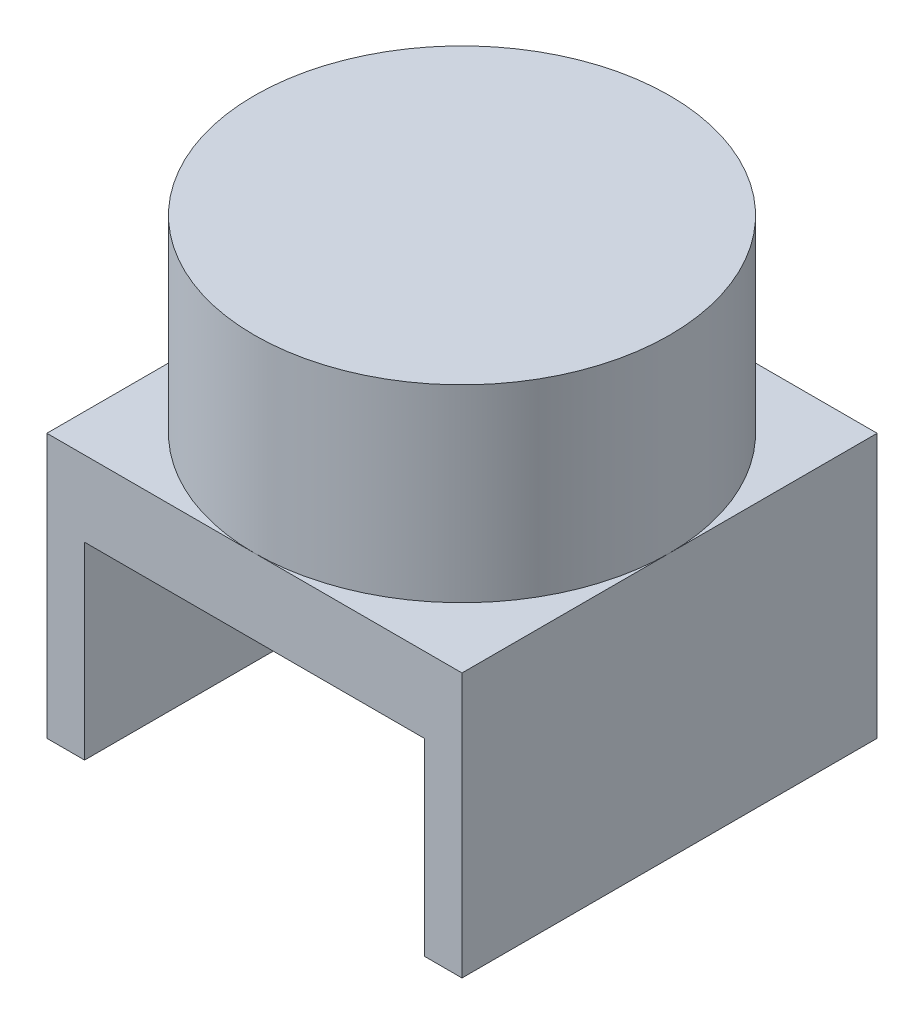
ISO-10303-21;
HEADER;
FILE_DESCRIPTION(('STEP AP214'),'2;1');
FILE_NAME('part.step','',(''),(''),'','','');
FILE_SCHEMA(('AUTOMOTIVE_DESIGN { 1 0 10303 214 1 1 1 1 }'));
ENDSEC;
DATA;
#1=APPLICATION_CONTEXT('core data for automotive mechanical design processes');
#2=APPLICATION_PROTOCOL_DEFINITION('international standard','automotive_design',2000,#1);
#3=PRODUCT_CONTEXT('',#1,'mechanical');
#4=PRODUCT('Part','Part','',(#3));
#5=PRODUCT_RELATED_PRODUCT_CATEGORY('part','',(#4));
#6=PRODUCT_DEFINITION_FORMATION('','',#4);
#7=PRODUCT_DEFINITION_CONTEXT('part definition',#1,'design');
#8=PRODUCT_DEFINITION('design','',#6,#7);
#9=PRODUCT_DEFINITION_SHAPE('','',#8);
#10=(LENGTH_UNIT() NAMED_UNIT(*) SI_UNIT(.MILLI.,.METRE.));
#11=(NAMED_UNIT(*) PLANE_ANGLE_UNIT() SI_UNIT($,.RADIAN.));
#12=(NAMED_UNIT(*) SI_UNIT($,.STERADIAN.) SOLID_ANGLE_UNIT());
#13=UNCERTAINTY_MEASURE_WITH_UNIT(LENGTH_MEASURE(1.E-05),#10,'distance_accuracy_value','');
#14=(GEOMETRIC_REPRESENTATION_CONTEXT(3) GLOBAL_UNCERTAINTY_ASSIGNED_CONTEXT((#13)) GLOBAL_UNIT_ASSIGNED_CONTEXT((#10,
#11,#12)) REPRESENTATION_CONTEXT('',''));
#15=CARTESIAN_POINT('',(0.,0.,0.));
#16=DIRECTION('',(0.,0.,1.));
#17=DIRECTION('',(1.,0.,0.));
#18=AXIS2_PLACEMENT_3D('',#15,#16,#17);
#19=CARTESIAN_POINT('',(0.,-20.,0.));
#20=DIRECTION('',(0.,1.,0.));
#21=DIRECTION('',(0.,0.,1.));
#22=AXIS2_PLACEMENT_3D('',#19,#20,#21);
#23=PLANE('',#22);
#24=DIRECTION('',(0.,0.,-1.));
#25=VECTOR('',#24,1.);
#26=CARTESIAN_POINT('',(45.,-20.,55.));
#27=LINE('',#26,#25);
#28=CARTESIAN_POINT('',(45.,-20.,55.));
#29=VERTEX_POINT('',#28);
#30=CARTESIAN_POINT('',(45.,-20.,-55.));
#31=VERTEX_POINT('',#30);
#32=EDGE_CURVE('E54',#29,#31,#27,.T.);
#33=ORIENTED_EDGE('',*,*,#32,.F.);
#34=DIRECTION('',(-1.,0.,0.));
#35=VECTOR('',#34,1.);
#36=CARTESIAN_POINT('',(-55.,-20.,55.));
#37=LINE('',#36,#35);
#38=CARTESIAN_POINT('',(-45.,-20.,55.));
#39=VERTEX_POINT('',#38);
#40=EDGE_CURVE('E167',#29,#39,#37,.T.);
#41=ORIENTED_EDGE('',*,*,#40,.T.);
#42=DIRECTION('',(0.,0.,1.));
#43=VECTOR('',#42,1.);
#44=CARTESIAN_POINT('',(-45.,-20.,55.));
#45=LINE('',#44,#43);
#46=CARTESIAN_POINT('',(-45.,-20.,-55.));
#47=VERTEX_POINT('',#46);
#48=EDGE_CURVE('E143',#47,#39,#45,.T.);
#49=ORIENTED_EDGE('',*,*,#48,.F.);
#50=DIRECTION('',(1.,0.,0.));
#51=VECTOR('',#50,1.);
#52=CARTESIAN_POINT('',(55.,-20.,-55.));
#53=LINE('',#52,#51);
#54=EDGE_CURVE('E59',#47,#31,#53,.T.);
#55=ORIENTED_EDGE('',*,*,#54,.T.);
#56=EDGE_LOOP('',(#33,#41,#49,#55));
#57=FACE_BOUND('',#56,.T.);
#58=ADVANCED_FACE('F39',(#57),#23,.F.);
#59=CARTESIAN_POINT('',(0.,50.,0.));
#60=DIRECTION('',(0.,-1.,0.));
#61=DIRECTION('',(0.,0.,-1.));
#62=AXIS2_PLACEMENT_3D('',#59,#60,#61);
#63=CYLINDRICAL_SURFACE('',#62,55.);
#64=CARTESIAN_POINT('',(0.,50.,0.));
#65=DIRECTION('',(0.,1.,0.));
#66=DIRECTION('',(0.,0.,1.));
#67=AXIS2_PLACEMENT_3D('',#64,#65,#66);
#68=CIRCLE('',#67,55.);
#69=CARTESIAN_POINT('',(0.,50.,55.));
#70=VERTEX_POINT('',#69);
#71=EDGE_CURVE('E11',#70,#70,#68,.T.);
#72=ORIENTED_EDGE('',*,*,#71,.F.);
#73=EDGE_LOOP('',(#72));
#74=FACE_BOUND('',#73,.T.);
#75=CARTESIAN_POINT('',(0.,0.,0.));
#76=DIRECTION('',(0.,1.,0.));
#77=DIRECTION('',(0.,0.,1.));
#78=AXIS2_PLACEMENT_3D('',#75,#76,#77);
#79=CIRCLE('',#78,55.);
#80=CARTESIAN_POINT('',(0.,0.,55.));
#81=VERTEX_POINT('',#80);
#82=CARTESIAN_POINT('',(55.,0.,0.));
#83=VERTEX_POINT('',#82);
#84=EDGE_CURVE('E43',#81,#83,#79,.T.);
#85=ORIENTED_EDGE('',*,*,#84,.T.);
#86=CARTESIAN_POINT('',(0.,0.,-55.));
#87=VERTEX_POINT('',#86);
#88=EDGE_CURVE('E193',#83,#87,#79,.T.);
#89=ORIENTED_EDGE('',*,*,#88,.T.);
#90=CARTESIAN_POINT('',(-55.,0.,0.));
#91=VERTEX_POINT('',#90);
#92=EDGE_CURVE('E189',#87,#91,#79,.T.);
#93=ORIENTED_EDGE('',*,*,#92,.T.);
#94=EDGE_CURVE('E186',#91,#81,#79,.T.);
#95=ORIENTED_EDGE('',*,*,#94,.T.);
#96=EDGE_LOOP('',(#85,#89,#93,#95));
#97=FACE_BOUND('',#96,.T.);
#98=ADVANCED_FACE('F41',(#74,#97),#63,.T.);
#99=CARTESIAN_POINT('',(0.,50.,0.));
#100=DIRECTION('',(0.,1.,0.));
#101=DIRECTION('',(0.,0.,1.));
#102=AXIS2_PLACEMENT_3D('',#99,#100,#101);
#103=PLANE('',#102);
#104=ORIENTED_EDGE('',*,*,#71,.T.);
#105=EDGE_LOOP('',(#104));
#106=FACE_BOUND('',#105,.T.);
#107=ADVANCED_FACE('F243',(#106),#103,.T.);
#108=CARTESIAN_POINT('',(0.,0.,0.));
#109=DIRECTION('',(0.,1.,0.));
#110=DIRECTION('',(0.,0.,1.));
#111=AXIS2_PLACEMENT_3D('',#108,#109,#110);
#112=PLANE('',#111);
#113=ORIENTED_EDGE('',*,*,#84,.F.);
#114=DIRECTION('',(-1.,0.,0.));
#115=VECTOR('',#114,1.);
#116=CARTESIAN_POINT('',(-55.,0.,55.));
#117=LINE('',#116,#115);
#118=CARTESIAN_POINT('',(55.,0.,55.));
#119=VERTEX_POINT('',#118);
#120=EDGE_CURVE('E174',#119,#81,#117,.T.);
#121=ORIENTED_EDGE('',*,*,#120,.F.);
#122=DIRECTION('',(0.,0.,1.));
#123=VECTOR('',#122,1.);
#124=CARTESIAN_POINT('',(55.,0.,55.));
#125=LINE('',#124,#123);
#126=EDGE_CURVE('E166',#83,#119,#125,.T.);
#127=ORIENTED_EDGE('',*,*,#126,.F.);
#128=EDGE_LOOP('',(#113,#121,#127));
#129=FACE_BOUND('',#128,.T.);
#130=ADVANCED_FACE('F201',(#129),#112,.T.);
#131=ORIENTED_EDGE('',*,*,#88,.F.);
#132=CARTESIAN_POINT('',(55.,0.,-55.));
#133=VERTEX_POINT('',#132);
#134=EDGE_CURVE('E171',#133,#83,#125,.T.);
#135=ORIENTED_EDGE('',*,*,#134,.F.);
#136=DIRECTION('',(1.,0.,0.));
#137=VECTOR('',#136,1.);
#138=CARTESIAN_POINT('',(55.,0.,-55.));
#139=LINE('',#138,#137);
#140=EDGE_CURVE('E121',#87,#133,#139,.T.);
#141=ORIENTED_EDGE('',*,*,#140,.F.);
#142=EDGE_LOOP('',(#131,#135,#141));
#143=FACE_BOUND('',#142,.T.);
#144=ADVANCED_FACE('F198',(#143),#112,.T.);
#145=ORIENTED_EDGE('',*,*,#92,.F.);
#146=CARTESIAN_POINT('',(-55.,0.,-55.));
#147=VERTEX_POINT('',#146);
#148=EDGE_CURVE('E169',#147,#87,#139,.T.);
#149=ORIENTED_EDGE('',*,*,#148,.F.);
#150=DIRECTION('',(0.,0.,-1.));
#151=VECTOR('',#150,1.);
#152=CARTESIAN_POINT('',(-55.,0.,-55.));
#153=LINE('',#152,#151);
#154=EDGE_CURVE('E176',#91,#147,#153,.T.);
#155=ORIENTED_EDGE('',*,*,#154,.F.);
#156=EDGE_LOOP('',(#145,#149,#155));
#157=FACE_BOUND('',#156,.T.);
#158=ADVANCED_FACE('F229',(#157),#112,.T.);
#159=ORIENTED_EDGE('',*,*,#94,.F.);
#160=CARTESIAN_POINT('',(-55.,0.,55.));
#161=VERTEX_POINT('',#160);
#162=EDGE_CURVE('E177',#161,#91,#153,.T.);
#163=ORIENTED_EDGE('',*,*,#162,.F.);
#164=EDGE_CURVE('E173',#81,#161,#117,.T.);
#165=ORIENTED_EDGE('',*,*,#164,.F.);
#166=EDGE_LOOP('',(#159,#163,#165));
#167=FACE_BOUND('',#166,.T.);
#168=ADVANCED_FACE('F206',(#167),#112,.T.);
#169=CARTESIAN_POINT('',(55.,-20.,55.));
#170=DIRECTION('',(-1.,0.,0.));
#171=DIRECTION('',(0.,0.,1.));
#172=AXIS2_PLACEMENT_3D('',#169,#170,#171);
#173=PLANE('',#172);
#174=ORIENTED_EDGE('',*,*,#134,.T.);
#175=ORIENTED_EDGE('',*,*,#126,.T.);
#176=DIRECTION('',(0.,1.,0.));
#177=VECTOR('',#176,1.);
#178=CARTESIAN_POINT('',(55.,-20.,55.));
#179=LINE('',#178,#177);
#180=CARTESIAN_POINT('',(55.,-70.,55.));
#181=VERTEX_POINT('',#180);
#182=EDGE_CURVE('E139',#181,#119,#179,.T.);
#183=ORIENTED_EDGE('',*,*,#182,.F.);
#184=DIRECTION('',(0.,0.,1.));
#185=VECTOR('',#184,1.);
#186=CARTESIAN_POINT('',(55.,-70.,-55.));
#187=LINE('',#186,#185);
#188=CARTESIAN_POINT('',(55.,-70.,-55.));
#189=VERTEX_POINT('',#188);
#190=EDGE_CURVE('E131',#189,#181,#187,.T.);
#191=ORIENTED_EDGE('',*,*,#190,.F.);
#192=DIRECTION('',(0.,1.,0.));
#193=VECTOR('',#192,1.);
#194=CARTESIAN_POINT('',(55.,-20.,-55.));
#195=LINE('',#194,#193);
#196=EDGE_CURVE('E114',#189,#133,#195,.T.);
#197=ORIENTED_EDGE('',*,*,#196,.T.);
#198=EDGE_LOOP('',(#174,#175,#183,#191,#197));
#199=FACE_BOUND('',#198,.T.);
#200=ADVANCED_FACE('F137',(#199),#173,.F.);
#201=CARTESIAN_POINT('',(-55.,-20.,55.));
#202=DIRECTION('',(0.,0.,-1.));
#203=DIRECTION('',(-1.,0.,0.));
#204=AXIS2_PLACEMENT_3D('',#201,#202,#203);
#205=PLANE('',#204);
#206=ORIENTED_EDGE('',*,*,#120,.T.);
#207=ORIENTED_EDGE('',*,*,#164,.T.);
#208=DIRECTION('',(0.,1.,0.));
#209=VECTOR('',#208,1.);
#210=CARTESIAN_POINT('',(-55.,-20.,55.));
#211=LINE('',#210,#209);
#212=CARTESIAN_POINT('',(-55.,-70.,55.));
#213=VERTEX_POINT('',#212);
#214=EDGE_CURVE('E183',#213,#161,#211,.T.);
#215=ORIENTED_EDGE('',*,*,#214,.F.);
#216=DIRECTION('',(-1.,0.,0.));
#217=VECTOR('',#216,1.);
#218=CARTESIAN_POINT('',(-55.,-70.,55.));
#219=LINE('',#218,#217);
#220=CARTESIAN_POINT('',(-45.,-70.,55.));
#221=VERTEX_POINT('',#220);
#222=EDGE_CURVE('E155',#221,#213,#219,.T.);
#223=ORIENTED_EDGE('',*,*,#222,.F.);
#224=DIRECTION('',(0.,1.,0.));
#225=VECTOR('',#224,1.);
#226=CARTESIAN_POINT('',(-45.,-70.,55.));
#227=LINE('',#226,#225);
#228=EDGE_CURVE('E158',#221,#39,#227,.T.);
#229=ORIENTED_EDGE('',*,*,#228,.T.);
#230=ORIENTED_EDGE('',*,*,#40,.F.);
#231=DIRECTION('',(0.,1.,0.));
#232=VECTOR('',#231,1.);
#233=CARTESIAN_POINT('',(45.,-70.,55.));
#234=LINE('',#233,#232);
#235=CARTESIAN_POINT('',(45.,-70.,55.));
#236=VERTEX_POINT('',#235);
#237=EDGE_CURVE('E222',#236,#29,#234,.T.);
#238=ORIENTED_EDGE('',*,*,#237,.F.);
#239=DIRECTION('',(-1.,0.,0.));
#240=VECTOR('',#239,1.);
#241=CARTESIAN_POINT('',(55.,-70.,55.));
#242=LINE('',#241,#240);
#243=EDGE_CURVE('E141',#181,#236,#242,.T.);
#244=ORIENTED_EDGE('',*,*,#243,.F.);
#245=ORIENTED_EDGE('',*,*,#182,.T.);
#246=EDGE_LOOP('',(#206,#207,#215,#223,#229,#230,#238,#244,#245));
#247=FACE_BOUND('',#246,.T.);
#248=ADVANCED_FACE('F203',(#247),#205,.F.);
#249=CARTESIAN_POINT('',(-55.,-20.,-55.));
#250=DIRECTION('',(1.,0.,0.));
#251=DIRECTION('',(0.,0.,-1.));
#252=AXIS2_PLACEMENT_3D('',#249,#250,#251);
#253=PLANE('',#252);
#254=ORIENTED_EDGE('',*,*,#162,.T.);
#255=ORIENTED_EDGE('',*,*,#154,.T.);
#256=DIRECTION('',(0.,1.,0.));
#257=VECTOR('',#256,1.);
#258=CARTESIAN_POINT('',(-55.,-20.,-55.));
#259=LINE('',#258,#257);
#260=CARTESIAN_POINT('',(-55.,-70.,-55.));
#261=VERTEX_POINT('',#260);
#262=EDGE_CURVE('E126',#261,#147,#259,.T.);
#263=ORIENTED_EDGE('',*,*,#262,.F.);
#264=DIRECTION('',(0.,0.,-1.));
#265=VECTOR('',#264,1.);
#266=CARTESIAN_POINT('',(-55.,-70.,-55.));
#267=LINE('',#266,#265);
#268=EDGE_CURVE('E148',#213,#261,#267,.T.);
#269=ORIENTED_EDGE('',*,*,#268,.F.);
#270=ORIENTED_EDGE('',*,*,#214,.T.);
#271=EDGE_LOOP('',(#254,#255,#263,#269,#270));
#272=FACE_BOUND('',#271,.T.);
#273=ADVANCED_FACE('F209',(#272),#253,.F.);
#274=CARTESIAN_POINT('',(55.,-20.,-55.));
#275=DIRECTION('',(0.,0.,1.));
#276=DIRECTION('',(1.,0.,0.));
#277=AXIS2_PLACEMENT_3D('',#274,#275,#276);
#278=PLANE('',#277);
#279=ORIENTED_EDGE('',*,*,#148,.T.);
#280=ORIENTED_EDGE('',*,*,#140,.T.);
#281=ORIENTED_EDGE('',*,*,#196,.F.);
#282=DIRECTION('',(1.,0.,0.));
#283=VECTOR('',#282,1.);
#284=CARTESIAN_POINT('',(45.,-70.,-55.));
#285=LINE('',#284,#283);
#286=CARTESIAN_POINT('',(45.,-70.,-55.));
#287=VERTEX_POINT('',#286);
#288=EDGE_CURVE('E119',#287,#189,#285,.T.);
#289=ORIENTED_EDGE('',*,*,#288,.F.);
#290=DIRECTION('',(0.,1.,0.));
#291=VECTOR('',#290,1.);
#292=CARTESIAN_POINT('',(45.,-70.,-55.));
#293=LINE('',#292,#291);
#294=EDGE_CURVE('E135',#287,#31,#293,.T.);
#295=ORIENTED_EDGE('',*,*,#294,.T.);
#296=ORIENTED_EDGE('',*,*,#54,.F.);
#297=DIRECTION('',(0.,1.,0.));
#298=VECTOR('',#297,1.);
#299=CARTESIAN_POINT('',(-45.,-70.,-55.));
#300=LINE('',#299,#298);
#301=CARTESIAN_POINT('',(-45.,-70.,-55.));
#302=VERTEX_POINT('',#301);
#303=EDGE_CURVE('E163',#302,#47,#300,.T.);
#304=ORIENTED_EDGE('',*,*,#303,.F.);
#305=DIRECTION('',(1.,0.,0.));
#306=VECTOR('',#305,1.);
#307=CARTESIAN_POINT('',(-45.,-70.,-55.));
#308=LINE('',#307,#306);
#309=EDGE_CURVE('E151',#261,#302,#308,.T.);
#310=ORIENTED_EDGE('',*,*,#309,.F.);
#311=ORIENTED_EDGE('',*,*,#262,.T.);
#312=EDGE_LOOP('',(#279,#280,#281,#289,#295,#296,#304,#310,#311));
#313=FACE_BOUND('',#312,.T.);
#314=ADVANCED_FACE('F117',(#313),#278,.F.);
#315=CARTESIAN_POINT('',(-45.,-70.,55.));
#316=DIRECTION('',(-1.,0.,0.));
#317=DIRECTION('',(0.,0.,1.));
#318=AXIS2_PLACEMENT_3D('',#315,#316,#317);
#319=PLANE('',#318);
#320=ORIENTED_EDGE('',*,*,#48,.T.);
#321=ORIENTED_EDGE('',*,*,#228,.F.);
#322=DIRECTION('',(0.,0.,1.));
#323=VECTOR('',#322,1.);
#324=CARTESIAN_POINT('',(-45.,-70.,55.));
#325=LINE('',#324,#323);
#326=EDGE_CURVE('E153',#302,#221,#325,.T.);
#327=ORIENTED_EDGE('',*,*,#326,.F.);
#328=ORIENTED_EDGE('',*,*,#303,.T.);
#329=EDGE_LOOP('',(#320,#321,#327,#328));
#330=FACE_BOUND('',#329,.T.);
#331=ADVANCED_FACE('F219',(#330),#319,.F.);
#332=CARTESIAN_POINT('',(0.,-70.,0.));
#333=DIRECTION('',(0.,1.,0.));
#334=DIRECTION('',(0.,0.,1.));
#335=AXIS2_PLACEMENT_3D('',#332,#333,#334);
#336=PLANE('',#335);
#337=ORIENTED_EDGE('',*,*,#268,.T.);
#338=ORIENTED_EDGE('',*,*,#309,.T.);
#339=ORIENTED_EDGE('',*,*,#326,.T.);
#340=ORIENTED_EDGE('',*,*,#222,.T.);
#341=EDGE_LOOP('',(#337,#338,#339,#340));
#342=FACE_BOUND('',#341,.T.);
#343=ADVANCED_FACE('F213',(#342),#336,.F.);
#344=CARTESIAN_POINT('',(45.,-70.,55.));
#345=DIRECTION('',(1.,0.,0.));
#346=DIRECTION('',(0.,0.,-1.));
#347=AXIS2_PLACEMENT_3D('',#344,#345,#346);
#348=PLANE('',#347);
#349=ORIENTED_EDGE('',*,*,#32,.T.);
#350=ORIENTED_EDGE('',*,*,#294,.F.);
#351=DIRECTION('',(0.,0.,-1.));
#352=VECTOR('',#351,1.);
#353=CARTESIAN_POINT('',(45.,-70.,55.));
#354=LINE('',#353,#352);
#355=EDGE_CURVE('E133',#236,#287,#354,.T.);
#356=ORIENTED_EDGE('',*,*,#355,.F.);
#357=ORIENTED_EDGE('',*,*,#237,.T.);
#358=EDGE_LOOP('',(#349,#350,#356,#357));
#359=FACE_BOUND('',#358,.T.);
#360=ADVANCED_FACE('F224',(#359),#348,.F.);
#361=CARTESIAN_POINT('',(0.,-70.,0.));
#362=DIRECTION('',(0.,-1.,0.));
#363=DIRECTION('',(0.,0.,-1.));
#364=AXIS2_PLACEMENT_3D('',#361,#362,#363);
#365=PLANE('',#364);
#366=ORIENTED_EDGE('',*,*,#190,.T.);
#367=ORIENTED_EDGE('',*,*,#243,.T.);
#368=ORIENTED_EDGE('',*,*,#355,.T.);
#369=ORIENTED_EDGE('',*,*,#288,.T.);
#370=EDGE_LOOP('',(#366,#367,#368,#369));
#371=FACE_BOUND('',#370,.T.);
#372=ADVANCED_FACE('F130',(#371),#365,.T.);
#373=CLOSED_SHELL('',(#58,#98,#107,#130,#144,#158,#168,#200,#248,#273,#314,#331,#343,#360,#372));
#374=MANIFOLD_SOLID_BREP('B2',#373);
#375=ADVANCED_BREP_SHAPE_REPRESENTATION('',(#18,#374),#14);
#376=SHAPE_DEFINITION_REPRESENTATION(#9,#375);
ENDSEC;
END-ISO-10303-21;
